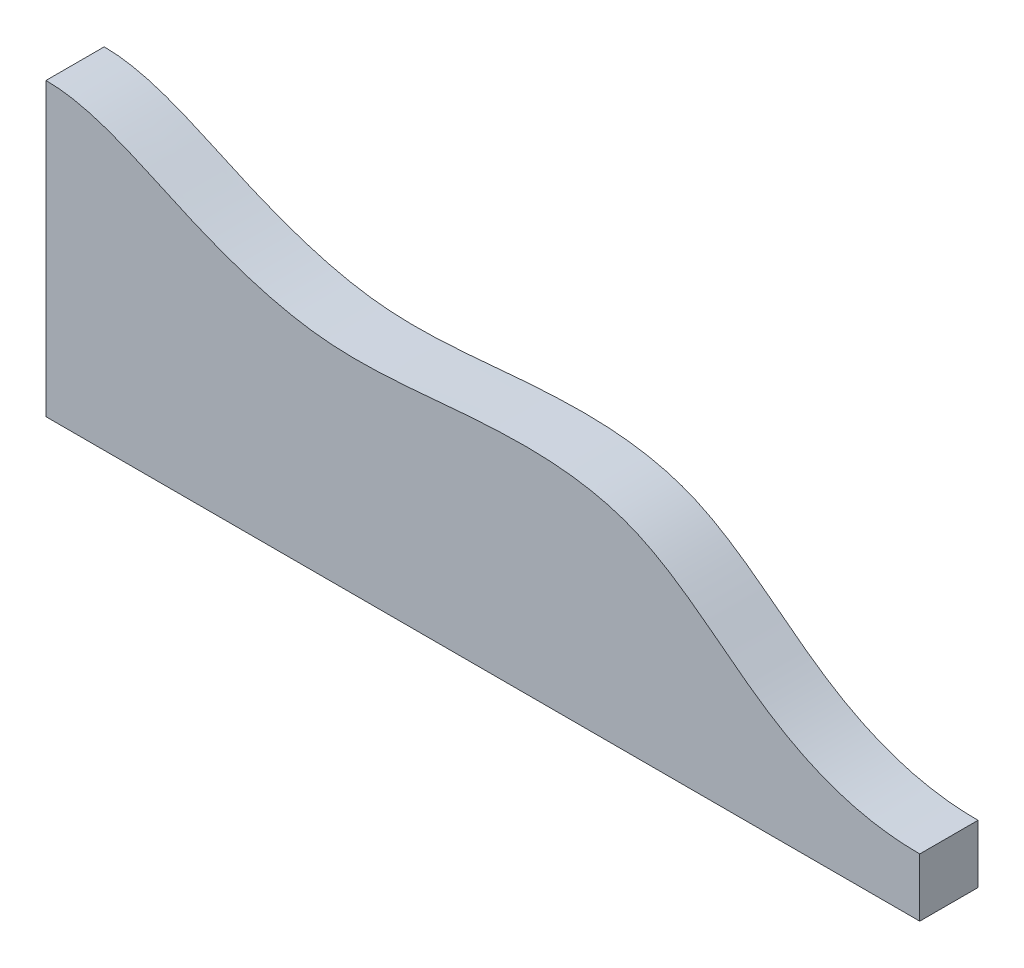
from build123d import *

# Parameters (mm, degrees)
GK_W                        = 300
GK_H                        = 100
AUFSATZ_LIN_GK_DEPTH        = 10
SCHNITT_LIN_OBEN_DEPTH      = 317.859590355
SCHNITT_LIN_OBEN_DEPTH_BACK = 20


with BuildPart() as part:
    # GK → Aufsatz-Lin_GK (new, symmetric)
    with BuildSketch(Plane.XY):
        with Locations((150, 50)):
            Rectangle(GK_W, GK_H)
    extrude(amount=AUFSATZ_LIN_GK_DEPTH, both=True)

    # Oben → Schnitt-Lin_Oben (cut, two sides: drawn at the far end of the back side and taken through both)
    with BuildSketch(Plane.XY.offset(10).offset(-SCHNITT_LIN_OBEN_DEPTH_BACK)):
        with BuildLine():
            Line((300, 100), (0, 100))
            add(Edge.make_bspline(
                [(0, 100), (15.959307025, 100), (46.924899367, 83.200742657), (95.246128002, 66.723284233), (147.465567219, 74.260824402), (204.051794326, 74.155389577), (245.685341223, 33.34383221), (278.80607512, 20), (300, 20)],
                knots=[0, 0, 0, 0, 0.155795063, 0.313363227, 0.478453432, 0.652442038, 0.821371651, 1, 1, 1, 1], degree=3))
            Line((300, 20), (300, 100))
        make_face()
    extrude(amount=SCHNITT_LIN_OBEN_DEPTH + SCHNITT_LIN_OBEN_DEPTH_BACK, mode=Mode.SUBTRACT)


solid = part.part
